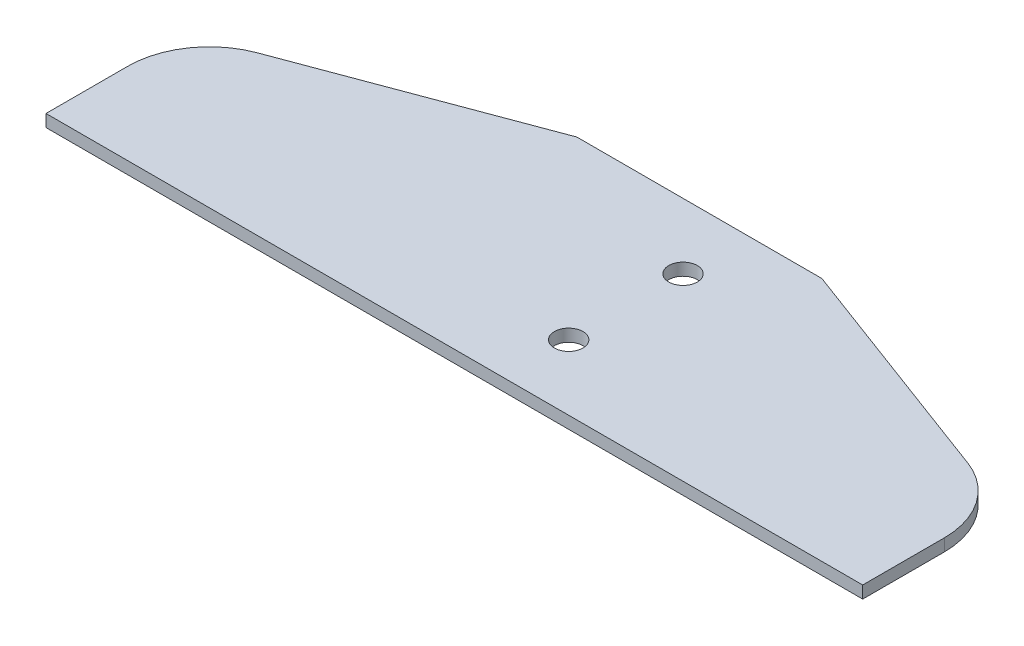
from build123d import *

# Parameters (mm, degrees)
SKETCH1_R      = 1.75
EXTRUDE1_DEPTH = 1.5


with BuildPart() as part:
    # Sketch1 → Extrude1 (new body)
    with BuildSketch(Plane(origin=(0, 0, 0), x_dir=(1, 0, 0), z_dir=(0, 1, 0))):
        with BuildLine():
            Line((-50, 0), (50, 0))
            Line((50, 0), (50, 10))
            ThreePointArc((50, 10), (48.214431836, 15.702903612), (43.495378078, 19.369222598))
            Line((43.495378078, 19.369222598), (15, 30))
            Line((15, 30), (-15, 30))
            Line((-15, 30), (-43.495378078, 19.369222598))
            ThreePointArc((-43.495378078, 19.369222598), (-48.214431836, 15.702903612), (-50, 10))
            Line((-50, 10), (-50, 0))
        make_face()
        with Locations(Location((6, 8, 0), (0, 0, 270))):
            Circle(SKETCH1_R, mode=Mode.SUBTRACT)
        with Locations(Location((6, 22, 0), (0, 0, 270))):
            Circle(SKETCH1_R, mode=Mode.SUBTRACT)
    extrude(amount=EXTRUDE1_DEPTH)


solid = part.part
